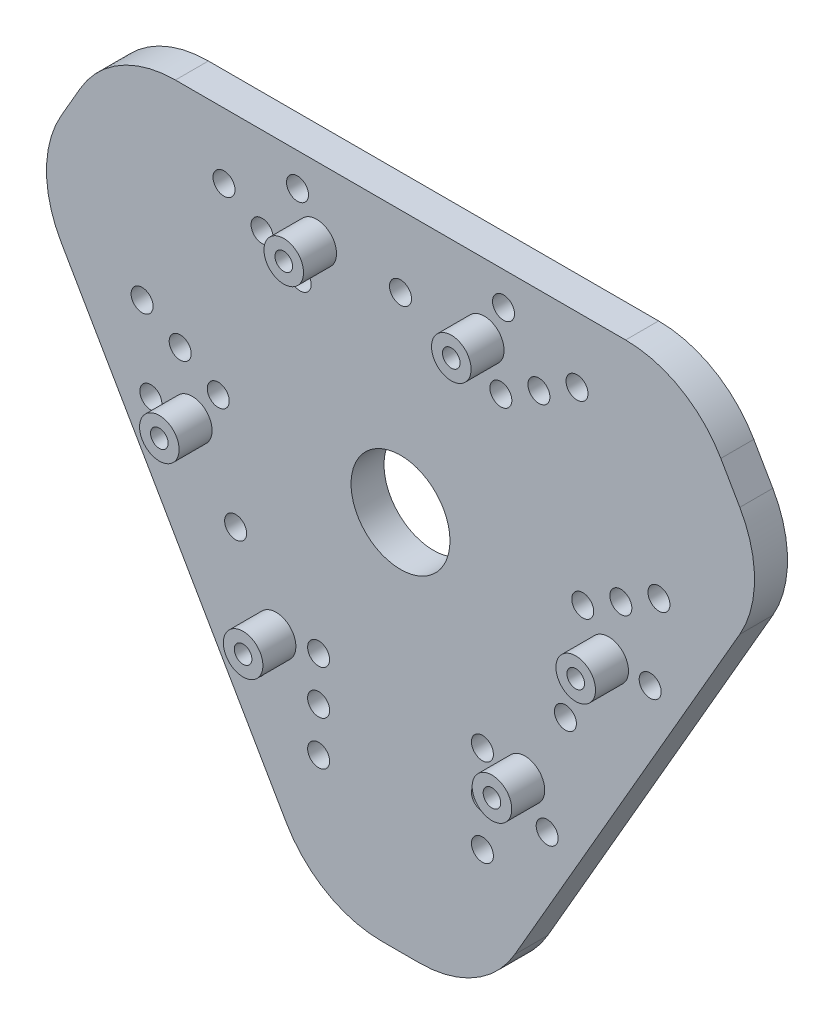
from build123d import *

# Parameters (mm, degrees)
EXTRUDE_1_DEPTH          = 3
SKETCH_2_R               = 1
CUT_EXTRUDE_1_DEPTH      = 55.476213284
SKETCH_3_R               = 4.5
CUT_EXTRUDE_2_DEPTH      = 55.476213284
SKETCH_4_R               = 1
CUT_EXTRUDE_3_DEPTH      = 55.476213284
PATTERN_CIRCULAR_1_COUNT = 3
FILLET_1_R               = 10
SKETCH_5_R               = 0.8
CUT_EXTRUDE_4_DEPTH      = 54.531562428
EXTRUDE_START            = 3
SKETCH_6_R               = 1.8
SKETCH_6_R_2             = 0.8
EXTRUDE_1_2_DEPTH        = 3
PATTERN_CIRCULAR_2_COUNT = 3


with BuildPart() as part:
    # Sketch 1 → Extrude 1 (new body)
    with BuildSketch(Plane.XY):
        Polygon((-7.5, -15.8), (7.5, -15.8), (33.75, 29.666333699), (26.25, 42.656714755), (-26.25, 42.656714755), (-33.75, 29.666333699), align=None)
    extrude(amount=EXTRUDE_1_DEPTH)

    # Sketch 2 → Cut-Extrude 1 (cut, through all)
    with BuildSketch(Plane.XY.offset(3)):
        with Locations((-9.127697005, 32.713413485)):
            Circle(SKETCH_2_R)
        with Locations((-12.59179862, 34.713413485)):
            Circle(SKETCH_2_R)
        with Locations((-16.577697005, 19.809634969)):
            Circle(SKETCH_2_R)
        with Locations((-20.04179862, 21.809634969)):
            Circle(SKETCH_2_R)
        with Locations((-23.505900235, 23.809634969)):
            Circle(SKETCH_2_R)
        with Locations((-16.055900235, 36.713413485)):
            Circle(SKETCH_2_R)
    cut_extrude_1 = extrude(amount=-CUT_EXTRUDE_1_DEPTH, mode=Mode.SUBTRACT)

    # Sketch 3 → Cut-Extrude 2 (cut, through all)
    with BuildSketch(Plane.XY.offset(3)):
        with Locations((0, 18.841016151)):
            Circle(SKETCH_3_R)
    extrude(amount=-CUT_EXTRUDE_2_DEPTH, mode=Mode.SUBTRACT)

    # Sketch 4 → Cut-Extrude 3 (cut, through all)
    with BuildSketch(Plane.XY.offset(3)):
        with Locations((-15, 10.180762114)):
            Circle(SKETCH_4_R)
        with Locations((-22.711570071, 16.547212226)):
            Circle(SKETCH_4_R)
        with Locations((-13.342277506, 0.319121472)):
            Circle(SKETCH_4_R)
    cut_extrude_3 = extrude(amount=-CUT_EXTRUDE_3_DEPTH, mode=Mode.SUBTRACT)

    # Pattern Circular 1: Cut-Extrude 1, Cut-Extrude 3 ×3 about axis
    pattern_circular_1_axis = Axis((0, 18.841016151, 0), (0, 0, 1))
    add([cut_extrude_1.rotate(pattern_circular_1_axis, i * 360 / PATTERN_CIRCULAR_1_COUNT) for i in range(1, PATTERN_CIRCULAR_1_COUNT)], mode=Mode.SUBTRACT)
    add([cut_extrude_3.rotate(pattern_circular_1_axis, i * 360 / PATTERN_CIRCULAR_1_COUNT) for i in range(1, PATTERN_CIRCULAR_1_COUNT)], mode=Mode.SUBTRACT)

    # Fillet 1
    fillet_1_edges = [part.edges().sort_by_distance(p)[0] for p in [
        (-33.75, 29.666333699, 1.5),
        (-26.25, 42.656714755, 1.5),
        (26.25, 42.656714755, 1.5),
        (33.75, 29.666333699, 1.5),
        (7.5, -15.8, 1.5),
        (-7.5, -15.8, 1.5),
    ]]
    fillet(fillet_1_edges, radius=FILLET_1_R)

    # Sketch 5 → Cut-Extrude 4 (cut, through all)
    with BuildSketch(Plane.XY.offset(3)):
        with Locations((7.62, 36.309503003)):
            Circle(SKETCH_5_R)
        with Locations((-7.62, 36.309503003)):
            Circle(SKETCH_5_R)
    cut_extrude_4 = extrude(amount=-CUT_EXTRUDE_4_DEPTH, mode=Mode.SUBTRACT)

    # Sketch 6 → Extrude 1 2 (add)
    # profile 1 of 2: a face of its own
    with BuildSketch(Plane.XY.offset(3).offset(EXTRUDE_START)):
        with Locations((7.62, 36.309503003)):
            Circle(SKETCH_6_R)
        with Locations((7.62, 36.309503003)):
            Circle(SKETCH_6_R_2, mode=Mode.SUBTRACT)
    # profile 2 of 2: a face of its own
    with BuildSketch(Plane.XY.offset(3).offset(EXTRUDE_START)):
        with Locations((-7.62, 36.309503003)):
            Circle(SKETCH_6_R)
        with Locations((-7.62, 36.309503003)):
            Circle(SKETCH_6_R_2, mode=Mode.SUBTRACT)
    extrude_1_2 = extrude(amount=-EXTRUDE_1_2_DEPTH)

    # Pattern Circular 2: Cut-Extrude 4, Extrude 1 2 ×3 about axis
    pattern_circular_2_axis = Axis((0, 18.841016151, 0), (0, 0, 1))
    add([cut_extrude_4.rotate(pattern_circular_2_axis, i * 360 / PATTERN_CIRCULAR_2_COUNT) for i in range(1, PATTERN_CIRCULAR_2_COUNT)], mode=Mode.SUBTRACT)
    add([extrude_1_2.rotate(pattern_circular_2_axis, i * 360 / PATTERN_CIRCULAR_2_COUNT) for i in range(1, PATTERN_CIRCULAR_2_COUNT)])


solid = part.part
